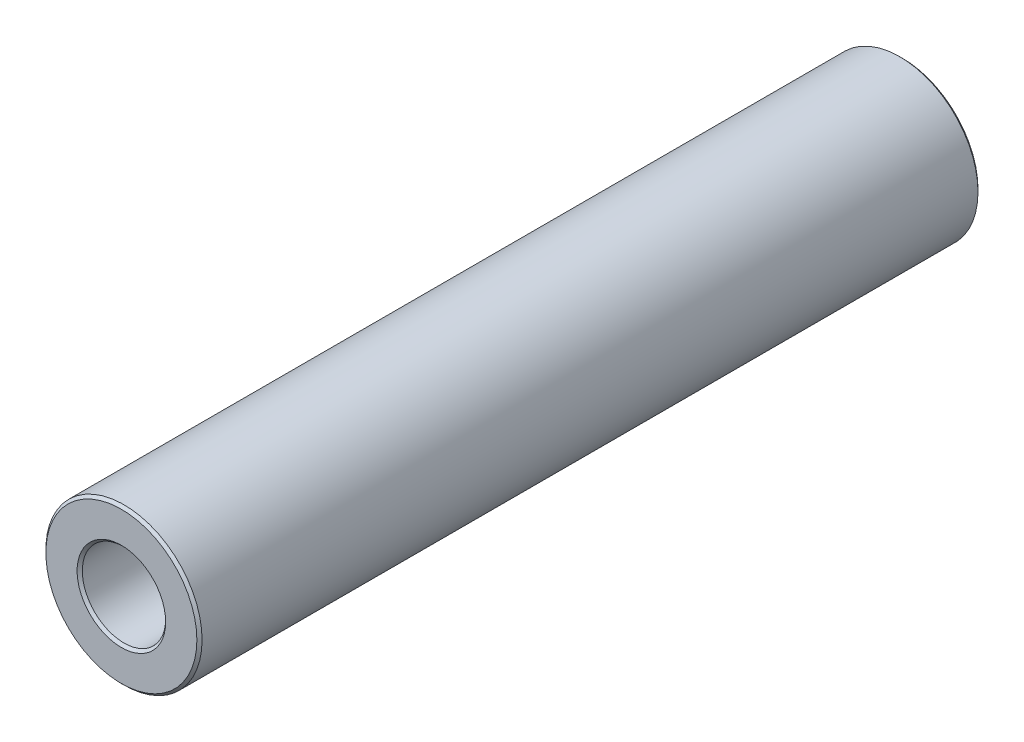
from build123d import *

# Parameters (mm, degrees)
SKETCH1_R           = 3
SKETCH1_R_2         = 1.6
BOSS_EXTRUDE2_DEPTH = 15
CHAMFER3_SIZE       = 0.1


with BuildPart() as part:
    # Sketch1 → Boss-Extrude2 (new, symmetric)
    with BuildSketch(Plane.XY):
        Circle(SKETCH1_R)
        Circle(SKETCH1_R_2, mode=Mode.SUBTRACT)
    extrude(amount=BOSS_EXTRUDE2_DEPTH, both=True)

    # Chamfer3
    chamfer3_edges = [part.edges().sort_by_distance(p)[0] for p in [
        (-3, 0, -15),
        (-3, 0, 15),
        (-1.6, 0, -15),
        (-1.6, 0, 15),
    ]]
    chamfer(chamfer3_edges, length=CHAMFER3_SIZE)


solid = part.part
